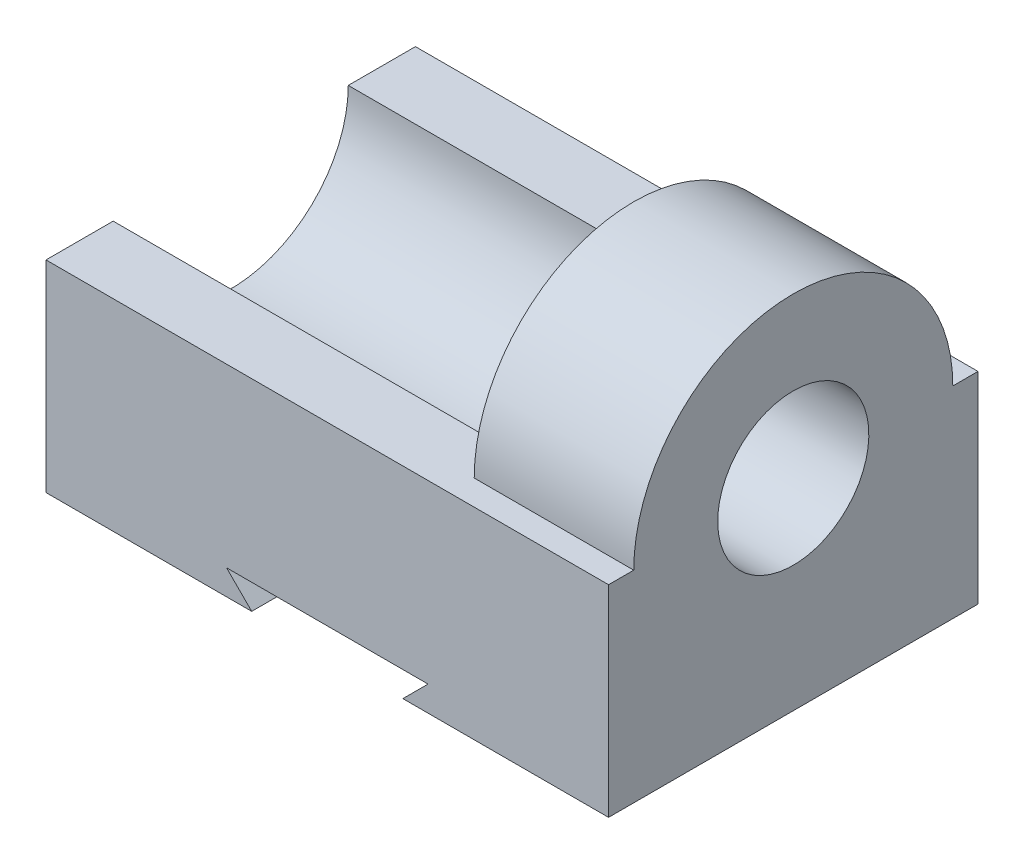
ISO-10303-21;
HEADER;
FILE_DESCRIPTION(('STEP AP214'),'2;1');
FILE_NAME('part.step','',(''),(''),'','','');
FILE_SCHEMA(('AUTOMOTIVE_DESIGN { 1 0 10303 214 1 1 1 1 }'));
ENDSEC;
DATA;
#1=APPLICATION_CONTEXT('core data for automotive mechanical design processes');
#2=APPLICATION_PROTOCOL_DEFINITION('international standard','automotive_design',2000,#1);
#3=PRODUCT_CONTEXT('',#1,'mechanical');
#4=PRODUCT('Part','Part','',(#3));
#5=PRODUCT_RELATED_PRODUCT_CATEGORY('part','',(#4));
#6=PRODUCT_DEFINITION_FORMATION('','',#4);
#7=PRODUCT_DEFINITION_CONTEXT('part definition',#1,'design');
#8=PRODUCT_DEFINITION('design','',#6,#7);
#9=PRODUCT_DEFINITION_SHAPE('','',#8);
#10=(LENGTH_UNIT() NAMED_UNIT(*) SI_UNIT(.MILLI.,.METRE.));
#11=(NAMED_UNIT(*) PLANE_ANGLE_UNIT() SI_UNIT($,.RADIAN.));
#12=(NAMED_UNIT(*) SI_UNIT($,.STERADIAN.) SOLID_ANGLE_UNIT());
#13=UNCERTAINTY_MEASURE_WITH_UNIT(LENGTH_MEASURE(1.E-05),#10,'distance_accuracy_value','');
#14=(GEOMETRIC_REPRESENTATION_CONTEXT(3) GLOBAL_UNCERTAINTY_ASSIGNED_CONTEXT((#13)) GLOBAL_UNIT_ASSIGNED_CONTEXT((#10,
#11,#12)) REPRESENTATION_CONTEXT('',''));
#15=CARTESIAN_POINT('',(0.,0.,0.));
#16=DIRECTION('',(0.,0.,1.));
#17=DIRECTION('',(1.,0.,0.));
#18=AXIS2_PLACEMENT_3D('',#15,#16,#17);
#19=CARTESIAN_POINT('',(67.,24.,22.));
#20=DIRECTION('',(0.,-1.,0.));
#21=DIRECTION('',(0.,0.,-1.));
#22=AXIS2_PLACEMENT_3D('',#19,#20,#21);
#23=PLANE('',#22);
#24=DIRECTION('',(0.,0.,-1.));
#25=VECTOR('',#24,1.);
#26=CARTESIAN_POINT('',(48.,24.,-19.));
#27=LINE('',#26,#25);
#28=CARTESIAN_POINT('',(48.,24.,19.));
#29=VERTEX_POINT('',#28);
#30=CARTESIAN_POINT('',(48.,24.,14.));
#31=VERTEX_POINT('',#30);
#32=EDGE_CURVE('E140',#29,#31,#27,.T.);
#33=ORIENTED_EDGE('',*,*,#32,.T.);
#34=DIRECTION('',(-1.,0.,0.));
#35=VECTOR('',#34,1.);
#36=CARTESIAN_POINT('',(87.5979797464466,24.,14.));
#37=LINE('',#36,#35);
#38=CARTESIAN_POINT('',(0.,24.,14.));
#39=VERTEX_POINT('',#38);
#40=EDGE_CURVE('E127',#31,#39,#37,.T.);
#41=ORIENTED_EDGE('',*,*,#40,.T.);
#42=DIRECTION('',(0.,0.,-1.));
#43=VECTOR('',#42,1.);
#44=CARTESIAN_POINT('',(0.,24.,22.));
#45=LINE('',#44,#43);
#46=CARTESIAN_POINT('',(0.,24.,22.));
#47=VERTEX_POINT('',#46);
#48=EDGE_CURVE('E187',#47,#39,#45,.T.);
#49=ORIENTED_EDGE('',*,*,#48,.F.);
#50=DIRECTION('',(-1.,0.,0.));
#51=VECTOR('',#50,1.);
#52=CARTESIAN_POINT('',(67.,24.,22.));
#53=LINE('',#52,#51);
#54=CARTESIAN_POINT('',(67.,24.,22.));
#55=VERTEX_POINT('',#54);
#56=EDGE_CURVE('E169',#55,#47,#53,.T.);
#57=ORIENTED_EDGE('',*,*,#56,.F.);
#58=DIRECTION('',(0.,0.,-1.));
#59=VECTOR('',#58,1.);
#60=CARTESIAN_POINT('',(67.,24.,22.));
#61=LINE('',#60,#59);
#62=CARTESIAN_POINT('',(67.,24.,19.));
#63=VERTEX_POINT('',#62);
#64=EDGE_CURVE('E191',#55,#63,#61,.T.);
#65=ORIENTED_EDGE('',*,*,#64,.T.);
#66=DIRECTION('',(1.,0.,0.));
#67=VECTOR('',#66,1.);
#68=CARTESIAN_POINT('',(48.,24.,19.));
#69=LINE('',#68,#67);
#70=EDGE_CURVE('E54',#29,#63,#69,.T.);
#71=ORIENTED_EDGE('',*,*,#70,.F.);
#72=EDGE_LOOP('',(#33,#41,#49,#57,#65,#71));
#73=FACE_BOUND('',#72,.T.);
#74=ADVANCED_FACE('F31',(#73),#23,.F.);
#75=CARTESIAN_POINT('',(0.,24.,22.));
#76=DIRECTION('',(1.,0.,0.));
#77=DIRECTION('',(0.,1.,0.));
#78=AXIS2_PLACEMENT_3D('',#75,#76,#77);
#79=PLANE('',#78);
#80=ORIENTED_EDGE('',*,*,#48,.T.);
#81=CARTESIAN_POINT('',(0.,24.,0.));
#82=DIRECTION('',(-1.,0.,0.));
#83=DIRECTION('',(0.,-1.,0.));
#84=AXIS2_PLACEMENT_3D('',#81,#82,#83);
#85=CIRCLE('',#84,14.);
#86=CARTESIAN_POINT('',(0.,24.,-14.));
#87=VERTEX_POINT('',#86);
#88=EDGE_CURVE('E130',#87,#39,#85,.T.);
#89=ORIENTED_EDGE('',*,*,#88,.F.);
#90=CARTESIAN_POINT('',(0.,24.,-22.));
#91=VERTEX_POINT('',#90);
#92=EDGE_CURVE('E135',#87,#91,#45,.T.);
#93=ORIENTED_EDGE('',*,*,#92,.T.);
#94=DIRECTION('',(0.,-1.,0.));
#95=VECTOR('',#94,1.);
#96=CARTESIAN_POINT('',(0.,24.,-22.));
#97=LINE('',#96,#95);
#98=CARTESIAN_POINT('',(0.,0.,-22.));
#99=VERTEX_POINT('',#98);
#100=EDGE_CURVE('E151',#91,#99,#97,.T.);
#101=ORIENTED_EDGE('',*,*,#100,.T.);
#102=DIRECTION('',(0.,0.,-1.));
#103=VECTOR('',#102,1.);
#104=CARTESIAN_POINT('',(0.,0.,22.));
#105=LINE('',#104,#103);
#106=CARTESIAN_POINT('',(0.,0.,22.));
#107=VERTEX_POINT('',#106);
#108=EDGE_CURVE('E39',#107,#99,#105,.T.);
#109=ORIENTED_EDGE('',*,*,#108,.F.);
#110=DIRECTION('',(0.,-1.,0.));
#111=VECTOR('',#110,1.);
#112=CARTESIAN_POINT('',(0.,24.,22.));
#113=LINE('',#112,#111);
#114=EDGE_CURVE('E153',#47,#107,#113,.T.);
#115=ORIENTED_EDGE('',*,*,#114,.F.);
#116=EDGE_LOOP('',(#80,#89,#93,#101,#109,#115));
#117=FACE_BOUND('',#116,.T.);
#118=ADVANCED_FACE('F33',(#117),#79,.F.);
#119=CARTESIAN_POINT('',(0.,0.,22.));
#120=DIRECTION('',(0.,1.,0.));
#121=DIRECTION('',(0.,0.,1.));
#122=AXIS2_PLACEMENT_3D('',#119,#120,#121);
#123=PLANE('',#122);
#124=DIRECTION('',(1.,0.,0.));
#125=VECTOR('',#124,1.);
#126=CARTESIAN_POINT('',(0.,0.,-22.));
#127=LINE('',#126,#125);
#128=CARTESIAN_POINT('',(24.5,0.,-22.));
#129=VERTEX_POINT('',#128);
#130=EDGE_CURVE('E173',#99,#129,#127,.T.);
#131=ORIENTED_EDGE('',*,*,#130,.T.);
#132=DIRECTION('',(0.,0.,-1.));
#133=VECTOR('',#132,1.);
#134=CARTESIAN_POINT('',(24.5,0.,22.));
#135=LINE('',#134,#133);
#136=CARTESIAN_POINT('',(24.5,0.,22.));
#137=VERTEX_POINT('',#136);
#138=EDGE_CURVE('E205',#137,#129,#135,.T.);
#139=ORIENTED_EDGE('',*,*,#138,.F.);
#140=DIRECTION('',(1.,0.,0.));
#141=VECTOR('',#140,1.);
#142=CARTESIAN_POINT('',(0.,0.,22.));
#143=LINE('',#142,#141);
#144=EDGE_CURVE('E156',#107,#137,#143,.T.);
#145=ORIENTED_EDGE('',*,*,#144,.F.);
#146=ORIENTED_EDGE('',*,*,#108,.T.);
#147=EDGE_LOOP('',(#131,#139,#145,#146));
#148=FACE_BOUND('',#147,.T.);
#149=ADVANCED_FACE('F210',(#148),#123,.F.);
#150=CARTESIAN_POINT('',(24.5,0.,22.));
#151=DIRECTION('',(-0.707106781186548,-0.707106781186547,0.));
#152=DIRECTION('',(0.707106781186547,-0.707106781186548,0.));
#153=AXIS2_PLACEMENT_3D('',#150,#151,#152);
#154=PLANE('',#153);
#155=DIRECTION('',(-0.707106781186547,0.707106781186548,0.));
#156=VECTOR('',#155,1.);
#157=CARTESIAN_POINT('',(24.5,0.,-22.));
#158=LINE('',#157,#156);
#159=CARTESIAN_POINT('',(21.5,3.,-22.));
#160=VERTEX_POINT('',#159);
#161=EDGE_CURVE('E175',#129,#160,#158,.T.);
#162=ORIENTED_EDGE('',*,*,#161,.T.);
#163=DIRECTION('',(0.,0.,-1.));
#164=VECTOR('',#163,1.);
#165=CARTESIAN_POINT('',(21.5,3.,22.));
#166=LINE('',#165,#164);
#167=CARTESIAN_POINT('',(21.5,3.,22.));
#168=VERTEX_POINT('',#167);
#169=EDGE_CURVE('E202',#168,#160,#166,.T.);
#170=ORIENTED_EDGE('',*,*,#169,.F.);
#171=DIRECTION('',(-0.707106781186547,0.707106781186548,0.));
#172=VECTOR('',#171,1.);
#173=CARTESIAN_POINT('',(24.5,0.,22.));
#174=LINE('',#173,#172);
#175=EDGE_CURVE('E159',#137,#168,#174,.T.);
#176=ORIENTED_EDGE('',*,*,#175,.F.);
#177=ORIENTED_EDGE('',*,*,#138,.T.);
#178=EDGE_LOOP('',(#162,#170,#176,#177));
#179=FACE_BOUND('',#178,.T.);
#180=ADVANCED_FACE('F224',(#179),#154,.F.);
#181=CARTESIAN_POINT('',(21.5,3.,22.));
#182=DIRECTION('',(0.,1.,0.));
#183=DIRECTION('',(0.,0.,1.));
#184=AXIS2_PLACEMENT_3D('',#181,#182,#183);
#185=PLANE('',#184);
#186=DIRECTION('',(1.,0.,0.));
#187=VECTOR('',#186,1.);
#188=CARTESIAN_POINT('',(21.5,3.,-22.));
#189=LINE('',#188,#187);
#190=CARTESIAN_POINT('',(45.5,3.,-22.));
#191=VERTEX_POINT('',#190);
#192=EDGE_CURVE('E177',#160,#191,#189,.T.);
#193=ORIENTED_EDGE('',*,*,#192,.T.);
#194=DIRECTION('',(0.,0.,-1.));
#195=VECTOR('',#194,1.);
#196=CARTESIAN_POINT('',(45.5,3.,22.));
#197=LINE('',#196,#195);
#198=CARTESIAN_POINT('',(45.5,3.,22.));
#199=VERTEX_POINT('',#198);
#200=EDGE_CURVE('E199',#199,#191,#197,.T.);
#201=ORIENTED_EDGE('',*,*,#200,.F.);
#202=DIRECTION('',(1.,0.,0.));
#203=VECTOR('',#202,1.);
#204=CARTESIAN_POINT('',(21.5,3.,22.));
#205=LINE('',#204,#203);
#206=EDGE_CURVE('E161',#168,#199,#205,.T.);
#207=ORIENTED_EDGE('',*,*,#206,.F.);
#208=ORIENTED_EDGE('',*,*,#169,.T.);
#209=EDGE_LOOP('',(#193,#201,#207,#208));
#210=FACE_BOUND('',#209,.T.);
#211=ADVANCED_FACE('F228',(#210),#185,.F.);
#212=CARTESIAN_POINT('',(45.5,3.,22.));
#213=DIRECTION('',(0.707106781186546,-0.707106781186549,0.));
#214=DIRECTION('',(0.707106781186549,0.707106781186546,0.));
#215=AXIS2_PLACEMENT_3D('',#212,#213,#214);
#216=PLANE('',#215);
#217=DIRECTION('',(-0.707106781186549,-0.707106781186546,0.));
#218=VECTOR('',#217,1.);
#219=CARTESIAN_POINT('',(45.5,3.,-22.));
#220=LINE('',#219,#218);
#221=CARTESIAN_POINT('',(42.5,0.,-22.));
#222=VERTEX_POINT('',#221);
#223=EDGE_CURVE('E179',#191,#222,#220,.T.);
#224=ORIENTED_EDGE('',*,*,#223,.T.);
#225=DIRECTION('',(0.,0.,-1.));
#226=VECTOR('',#225,1.);
#227=CARTESIAN_POINT('',(42.5,0.,22.));
#228=LINE('',#227,#226);
#229=CARTESIAN_POINT('',(42.5,0.,22.));
#230=VERTEX_POINT('',#229);
#231=EDGE_CURVE('E196',#230,#222,#228,.T.);
#232=ORIENTED_EDGE('',*,*,#231,.F.);
#233=DIRECTION('',(-0.707106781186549,-0.707106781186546,0.));
#234=VECTOR('',#233,1.);
#235=CARTESIAN_POINT('',(45.5,3.,22.));
#236=LINE('',#235,#234);
#237=EDGE_CURVE('E163',#199,#230,#236,.T.);
#238=ORIENTED_EDGE('',*,*,#237,.F.);
#239=ORIENTED_EDGE('',*,*,#200,.T.);
#240=EDGE_LOOP('',(#224,#232,#238,#239));
#241=FACE_BOUND('',#240,.T.);
#242=ADVANCED_FACE('F254',(#241),#216,.F.);
#243=CARTESIAN_POINT('',(42.5,0.,22.));
#244=DIRECTION('',(0.,1.,0.));
#245=DIRECTION('',(0.,0.,1.));
#246=AXIS2_PLACEMENT_3D('',#243,#244,#245);
#247=PLANE('',#246);
#248=DIRECTION('',(1.,0.,0.));
#249=VECTOR('',#248,1.);
#250=CARTESIAN_POINT('',(42.5,0.,-22.));
#251=LINE('',#250,#249);
#252=CARTESIAN_POINT('',(67.,0.,-22.));
#253=VERTEX_POINT('',#252);
#254=EDGE_CURVE('E181',#222,#253,#251,.T.);
#255=ORIENTED_EDGE('',*,*,#254,.T.);
#256=DIRECTION('',(0.,0.,-1.));
#257=VECTOR('',#256,1.);
#258=CARTESIAN_POINT('',(67.,0.,22.));
#259=LINE('',#258,#257);
#260=CARTESIAN_POINT('',(67.,0.,22.));
#261=VERTEX_POINT('',#260);
#262=EDGE_CURVE('E193',#261,#253,#259,.T.);
#263=ORIENTED_EDGE('',*,*,#262,.F.);
#264=DIRECTION('',(1.,0.,0.));
#265=VECTOR('',#264,1.);
#266=CARTESIAN_POINT('',(42.5,0.,22.));
#267=LINE('',#266,#265);
#268=EDGE_CURVE('E165',#230,#261,#267,.T.);
#269=ORIENTED_EDGE('',*,*,#268,.F.);
#270=ORIENTED_EDGE('',*,*,#231,.T.);
#271=EDGE_LOOP('',(#255,#263,#269,#270));
#272=FACE_BOUND('',#271,.T.);
#273=ADVANCED_FACE('F246',(#272),#247,.F.);
#274=CARTESIAN_POINT('',(67.,0.,22.));
#275=DIRECTION('',(-1.,0.,0.));
#276=DIRECTION('',(0.,-1.,0.));
#277=AXIS2_PLACEMENT_3D('',#274,#275,#276);
#278=PLANE('',#277);
#279=CARTESIAN_POINT('',(67.,24.,0.));
#280=DIRECTION('',(1.,0.,0.));
#281=DIRECTION('',(0.,1.,0.));
#282=AXIS2_PLACEMENT_3D('',#279,#280,#281);
#283=CIRCLE('',#282,9.);
#284=CARTESIAN_POINT('',(67.,33.,0.));
#285=VERTEX_POINT('',#284);
#286=EDGE_CURVE('E148',#285,#285,#283,.T.);
#287=ORIENTED_EDGE('',*,*,#286,.F.);
#288=EDGE_LOOP('',(#287));
#289=FACE_BOUND('',#288,.T.);
#290=DIRECTION('',(0.,1.,0.));
#291=VECTOR('',#290,1.);
#292=CARTESIAN_POINT('',(67.,0.,-22.));
#293=LINE('',#292,#291);
#294=CARTESIAN_POINT('',(67.,24.,-22.));
#295=VERTEX_POINT('',#294);
#296=EDGE_CURVE('E183',#253,#295,#293,.T.);
#297=ORIENTED_EDGE('',*,*,#296,.T.);
#298=CARTESIAN_POINT('',(67.,24.,-19.));
#299=VERTEX_POINT('',#298);
#300=EDGE_CURVE('E190',#299,#295,#61,.T.);
#301=ORIENTED_EDGE('',*,*,#300,.F.);
#302=CARTESIAN_POINT('',(67.,24.,0.));
#303=DIRECTION('',(1.,0.,0.));
#304=DIRECTION('',(0.,-1.,0.));
#305=AXIS2_PLACEMENT_3D('',#302,#303,#304);
#306=CIRCLE('',#305,19.);
#307=EDGE_CURVE('E142',#299,#63,#306,.T.);
#308=ORIENTED_EDGE('',*,*,#307,.T.);
#309=ORIENTED_EDGE('',*,*,#64,.F.);
#310=DIRECTION('',(0.,1.,0.));
#311=VECTOR('',#310,1.);
#312=CARTESIAN_POINT('',(67.,0.,22.));
#313=LINE('',#312,#311);
#314=EDGE_CURVE('E167',#261,#55,#313,.T.);
#315=ORIENTED_EDGE('',*,*,#314,.F.);
#316=ORIENTED_EDGE('',*,*,#262,.T.);
#317=EDGE_LOOP('',(#297,#301,#308,#309,#315,#316));
#318=FACE_BOUND('',#317,.T.);
#319=ADVANCED_FACE('F243',(#289,#318),#278,.F.);
#320=ORIENTED_EDGE('',*,*,#92,.F.);
#321=DIRECTION('',(-1.,0.,0.));
#322=VECTOR('',#321,1.);
#323=CARTESIAN_POINT('',(87.5979797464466,24.,-14.));
#324=LINE('',#323,#322);
#325=CARTESIAN_POINT('',(48.,24.,-14.));
#326=VERTEX_POINT('',#325);
#327=EDGE_CURVE('E124',#87,#326,#324,.F.);
#328=ORIENTED_EDGE('',*,*,#327,.T.);
#329=CARTESIAN_POINT('',(48.,24.,-19.));
#330=VERTEX_POINT('',#329);
#331=EDGE_CURVE('E46',#326,#330,#27,.T.);
#332=ORIENTED_EDGE('',*,*,#331,.T.);
#333=DIRECTION('',(1.,0.,0.));
#334=VECTOR('',#333,1.);
#335=CARTESIAN_POINT('',(48.,24.,-19.));
#336=LINE('',#335,#334);
#337=EDGE_CURVE('E149',#330,#299,#336,.T.);
#338=ORIENTED_EDGE('',*,*,#337,.T.);
#339=ORIENTED_EDGE('',*,*,#300,.T.);
#340=DIRECTION('',(-1.,0.,0.));
#341=VECTOR('',#340,1.);
#342=CARTESIAN_POINT('',(67.,24.,-22.));
#343=LINE('',#342,#341);
#344=EDGE_CURVE('E157',#295,#91,#343,.T.);
#345=ORIENTED_EDGE('',*,*,#344,.T.);
#346=EDGE_LOOP('',(#320,#328,#332,#338,#339,#345));
#347=FACE_BOUND('',#346,.T.);
#348=ADVANCED_FACE('F133',(#347),#23,.F.);
#349=CARTESIAN_POINT('',(0.,3.,22.));
#350=DIRECTION('',(0.,0.,1.));
#351=DIRECTION('',(1.,0.,0.));
#352=AXIS2_PLACEMENT_3D('',#349,#350,#351);
#353=PLANE('',#352);
#354=ORIENTED_EDGE('',*,*,#114,.T.);
#355=ORIENTED_EDGE('',*,*,#144,.T.);
#356=ORIENTED_EDGE('',*,*,#175,.T.);
#357=ORIENTED_EDGE('',*,*,#206,.T.);
#358=ORIENTED_EDGE('',*,*,#237,.T.);
#359=ORIENTED_EDGE('',*,*,#268,.T.);
#360=ORIENTED_EDGE('',*,*,#314,.T.);
#361=ORIENTED_EDGE('',*,*,#56,.T.);
#362=EDGE_LOOP('',(#354,#355,#356,#357,#358,#359,#360,#361));
#363=FACE_BOUND('',#362,.T.);
#364=ADVANCED_FACE('F232',(#363),#353,.T.);
#365=CARTESIAN_POINT('',(0.,3.,-22.));
#366=DIRECTION('',(0.,0.,1.));
#367=DIRECTION('',(1.,0.,0.));
#368=AXIS2_PLACEMENT_3D('',#365,#366,#367);
#369=PLANE('',#368);
#370=ORIENTED_EDGE('',*,*,#100,.F.);
#371=ORIENTED_EDGE('',*,*,#344,.F.);
#372=ORIENTED_EDGE('',*,*,#296,.F.);
#373=ORIENTED_EDGE('',*,*,#254,.F.);
#374=ORIENTED_EDGE('',*,*,#223,.F.);
#375=ORIENTED_EDGE('',*,*,#192,.F.);
#376=ORIENTED_EDGE('',*,*,#161,.F.);
#377=ORIENTED_EDGE('',*,*,#130,.F.);
#378=EDGE_LOOP('',(#370,#371,#372,#373,#374,#375,#376,#377));
#379=FACE_BOUND('',#378,.T.);
#380=ADVANCED_FACE('F217',(#379),#369,.F.);
#381=CARTESIAN_POINT('',(48.,24.,0.));
#382=DIRECTION('',(1.,0.,0.));
#383=DIRECTION('',(0.,1.,0.));
#384=AXIS2_PLACEMENT_3D('',#381,#382,#383);
#385=CYLINDRICAL_SURFACE('',#384,19.);
#386=ORIENTED_EDGE('',*,*,#307,.F.);
#387=ORIENTED_EDGE('',*,*,#337,.F.);
#388=CARTESIAN_POINT('',(48.,24.,0.));
#389=DIRECTION('',(1.,0.,0.));
#390=DIRECTION('',(0.,-1.,0.));
#391=AXIS2_PLACEMENT_3D('',#388,#389,#390);
#392=CIRCLE('',#391,19.);
#393=EDGE_CURVE('E139',#330,#29,#392,.T.);
#394=ORIENTED_EDGE('',*,*,#393,.T.);
#395=ORIENTED_EDGE('',*,*,#70,.T.);
#396=EDGE_LOOP('',(#386,#387,#394,#395));
#397=FACE_BOUND('',#396,.T.);
#398=ADVANCED_FACE('F277',(#397),#385,.T.);
#399=CARTESIAN_POINT('',(48.,24.,0.));
#400=DIRECTION('',(-1.,0.,0.));
#401=DIRECTION('',(0.,-1.,0.));
#402=AXIS2_PLACEMENT_3D('',#399,#400,#401);
#403=PLANE('',#402);
#404=CARTESIAN_POINT('',(48.,24.,0.));
#405=DIRECTION('',(-1.,0.,0.));
#406=DIRECTION('',(0.,-1.,0.));
#407=AXIS2_PLACEMENT_3D('',#404,#405,#406);
#408=CIRCLE('',#407,9.);
#409=CARTESIAN_POINT('',(48.,15.,0.));
#410=VERTEX_POINT('',#409);
#411=EDGE_CURVE('E11',#410,#410,#408,.T.);
#412=ORIENTED_EDGE('',*,*,#411,.F.);
#413=EDGE_LOOP('',(#412));
#414=FACE_BOUND('',#413,.T.);
#415=ORIENTED_EDGE('',*,*,#331,.F.);
#416=CARTESIAN_POINT('',(48.,24.0000000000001,0.));
#417=DIRECTION('',(-1.,0.,0.));
#418=DIRECTION('',(0.,-1.,0.));
#419=AXIS2_PLACEMENT_3D('',#416,#417,#418);
#420=CIRCLE('',#419,14.);
#421=EDGE_CURVE('E122',#31,#326,#420,.F.);
#422=ORIENTED_EDGE('',*,*,#421,.F.);
#423=ORIENTED_EDGE('',*,*,#32,.F.);
#424=ORIENTED_EDGE('',*,*,#393,.F.);
#425=EDGE_LOOP('',(#415,#422,#423,#424));
#426=FACE_BOUND('',#425,.T.);
#427=ADVANCED_FACE('F138',(#414,#426),#403,.T.);
#428=CARTESIAN_POINT('',(48.,24.,0.));
#429=DIRECTION('',(1.,0.,0.));
#430=DIRECTION('',(0.,1.,0.));
#431=AXIS2_PLACEMENT_3D('',#428,#429,#430);
#432=CYLINDRICAL_SURFACE('',#431,9.);
#433=ORIENTED_EDGE('',*,*,#411,.T.);
#434=EDGE_LOOP('',(#433));
#435=FACE_BOUND('',#434,.T.);
#436=ORIENTED_EDGE('',*,*,#286,.T.);
#437=EDGE_LOOP('',(#436));
#438=FACE_BOUND('',#437,.T.);
#439=ADVANCED_FACE('F241',(#435,#438),#432,.F.);
#440=CARTESIAN_POINT('',(87.5979797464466,24.0000000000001,0.));
#441=DIRECTION('',(-1.,0.,0.));
#442=DIRECTION('',(0.,-1.,0.));
#443=AXIS2_PLACEMENT_3D('',#440,#441,#442);
#444=CYLINDRICAL_SURFACE('',#443,14.);
#445=ORIENTED_EDGE('',*,*,#421,.T.);
#446=ORIENTED_EDGE('',*,*,#327,.F.);
#447=ORIENTED_EDGE('',*,*,#88,.T.);
#448=ORIENTED_EDGE('',*,*,#40,.F.);
#449=EDGE_LOOP('',(#445,#446,#447,#448));
#450=FACE_BOUND('',#449,.T.);
#451=ADVANCED_FACE('F123',(#450),#444,.F.);
#452=CLOSED_SHELL('',(#74,#118,#149,#180,#211,#242,#273,#319,#348,#364,#380,#398,#427,#439,#451));
#453=MANIFOLD_SOLID_BREP('B2',#452);
#454=ADVANCED_BREP_SHAPE_REPRESENTATION('',(#18,#453),#14);
#455=SHAPE_DEFINITION_REPRESENTATION(#9,#454);
ENDSEC;
END-ISO-10303-21;
